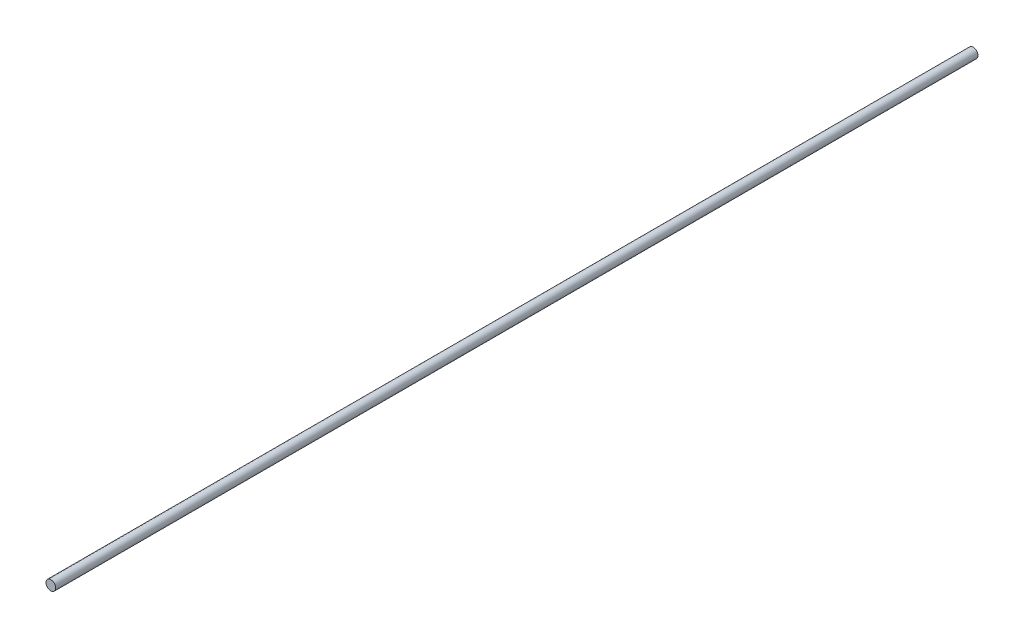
from build123d import *

# Parameters (mm, degrees)
SKETCH1_R           = 30
BOSS_EXTRUDE1_DEPTH = 5700


with BuildPart() as part:
    # Sketch1 → Boss-Extrude1 (new body)
    with BuildSketch(Plane.XY):
        Circle(SKETCH1_R)
    extrude(amount=-BOSS_EXTRUDE1_DEPTH)


solid = part.part
